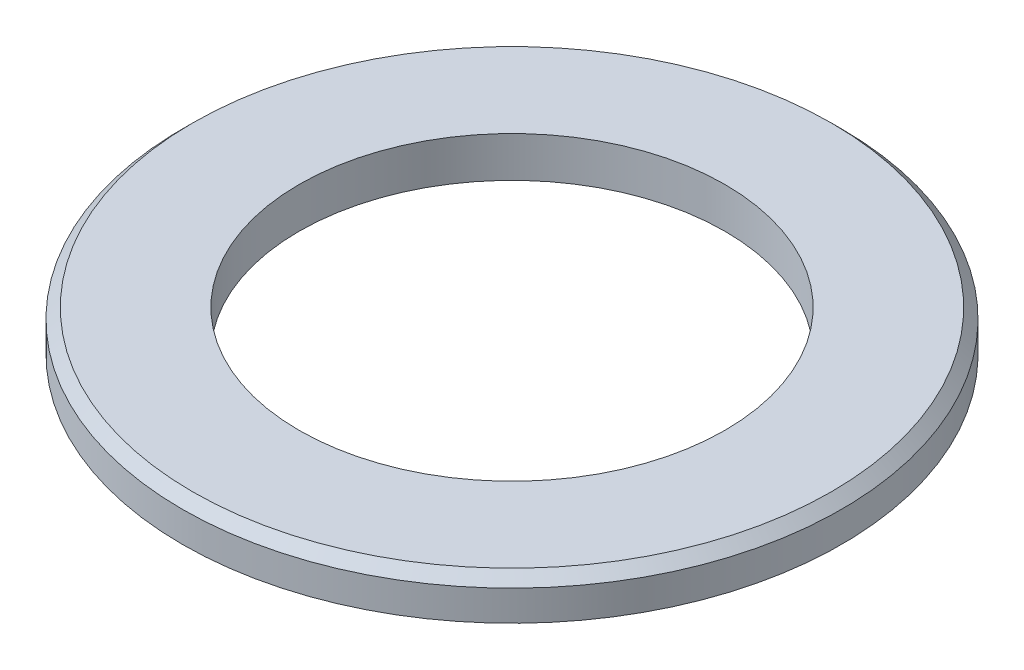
ISO-10303-21;
HEADER;
FILE_DESCRIPTION(('STEP AP214'),'2;1');
FILE_NAME('part.step','',(''),(''),'','','');
FILE_SCHEMA(('AUTOMOTIVE_DESIGN { 1 0 10303 214 1 1 1 1 }'));
ENDSEC;
DATA;
#1=APPLICATION_CONTEXT('core data for automotive mechanical design processes');
#2=APPLICATION_PROTOCOL_DEFINITION('international standard','automotive_design',2000,#1);
#3=PRODUCT_CONTEXT('',#1,'mechanical');
#4=PRODUCT('Part','Part','',(#3));
#5=PRODUCT_RELATED_PRODUCT_CATEGORY('part','',(#4));
#6=PRODUCT_DEFINITION_FORMATION('','',#4);
#7=PRODUCT_DEFINITION_CONTEXT('part definition',#1,'design');
#8=PRODUCT_DEFINITION('design','',#6,#7);
#9=PRODUCT_DEFINITION_SHAPE('','',#8);
#10=(LENGTH_UNIT() NAMED_UNIT(*) SI_UNIT(.MILLI.,.METRE.));
#11=(NAMED_UNIT(*) PLANE_ANGLE_UNIT() SI_UNIT($,.RADIAN.));
#12=(NAMED_UNIT(*) SI_UNIT($,.STERADIAN.) SOLID_ANGLE_UNIT());
#13=UNCERTAINTY_MEASURE_WITH_UNIT(LENGTH_MEASURE(1.E-05),#10,'distance_accuracy_value','');
#14=(GEOMETRIC_REPRESENTATION_CONTEXT(3) GLOBAL_UNCERTAINTY_ASSIGNED_CONTEXT((#13)) GLOBAL_UNIT_ASSIGNED_CONTEXT((#10,
#11,#12)) REPRESENTATION_CONTEXT('',''));
#15=CARTESIAN_POINT('',(0.,0.,0.));
#16=DIRECTION('',(0.,0.,1.));
#17=DIRECTION('',(1.,0.,0.));
#18=AXIS2_PLACEMENT_3D('',#15,#16,#17);
#19=CARTESIAN_POINT('',(0.,0.8,0.));
#20=DIRECTION('',(0.,1.,0.));
#21=DIRECTION('',(0.,0.,1.));
#22=AXIS2_PLACEMENT_3D('',#19,#20,#21);
#23=PLANE('',#22);
#24=CARTESIAN_POINT('',(0.,0.8,0.));
#25=DIRECTION('',(0.,1.,0.));
#26=DIRECTION('',(0.,0.,1.));
#27=AXIS2_PLACEMENT_3D('',#24,#25,#26);
#28=CIRCLE('',#27,6.3);
#29=CARTESIAN_POINT('',(0.,0.8,6.3));
#30=VERTEX_POINT('',#29);
#31=EDGE_CURVE('E39',#30,#30,#28,.T.);
#32=ORIENTED_EDGE('',*,*,#31,.T.);
#33=EDGE_LOOP('',(#32));
#34=FACE_BOUND('',#33,.T.);
#35=CARTESIAN_POINT('',(0.,0.8,0.));
#36=DIRECTION('',(0.,1.,0.));
#37=DIRECTION('',(0.,0.,1.));
#38=AXIS2_PLACEMENT_3D('',#35,#36,#37);
#39=CIRCLE('',#38,4.2);
#40=CARTESIAN_POINT('',(0.,0.8,4.2));
#41=VERTEX_POINT('',#40);
#42=EDGE_CURVE('E47',#41,#41,#39,.T.);
#43=ORIENTED_EDGE('',*,*,#42,.F.);
#44=EDGE_LOOP('',(#43));
#45=FACE_BOUND('',#44,.T.);
#46=ADVANCED_FACE('F32',(#34,#45),#23,.T.);
#47=CARTESIAN_POINT('',(0.,0.,0.));
#48=DIRECTION('',(0.,1.,0.));
#49=DIRECTION('',(0.,0.,1.));
#50=AXIS2_PLACEMENT_3D('',#47,#48,#49);
#51=PLANE('',#50);
#52=CARTESIAN_POINT('',(0.,0.,0.));
#53=DIRECTION('',(0.,1.,0.));
#54=DIRECTION('',(0.,0.,1.));
#55=AXIS2_PLACEMENT_3D('',#52,#53,#54);
#56=CIRCLE('',#55,6.5);
#57=CARTESIAN_POINT('',(0.,0.,6.5));
#58=VERTEX_POINT('',#57);
#59=EDGE_CURVE('E43',#58,#58,#56,.T.);
#60=ORIENTED_EDGE('',*,*,#59,.F.);
#61=EDGE_LOOP('',(#60));
#62=FACE_BOUND('',#61,.T.);
#63=CARTESIAN_POINT('',(0.,0.,0.));
#64=DIRECTION('',(0.,1.,0.));
#65=DIRECTION('',(0.,0.,1.));
#66=AXIS2_PLACEMENT_3D('',#63,#64,#65);
#67=CIRCLE('',#66,4.2);
#68=CARTESIAN_POINT('',(0.,0.,4.2));
#69=VERTEX_POINT('',#68);
#70=EDGE_CURVE('E50',#69,#69,#67,.T.);
#71=ORIENTED_EDGE('',*,*,#70,.T.);
#72=EDGE_LOOP('',(#71));
#73=FACE_BOUND('',#72,.T.);
#74=ADVANCED_FACE('F60',(#62,#73),#51,.F.);
#75=CARTESIAN_POINT('',(0.,0.8,0.));
#76=DIRECTION('',(0.,-1.,0.));
#77=DIRECTION('',(0.,0.,-1.));
#78=AXIS2_PLACEMENT_3D('',#75,#76,#77);
#79=CYLINDRICAL_SURFACE('',#78,6.5);
#80=CARTESIAN_POINT('',(0.,0.6,0.));
#81=DIRECTION('',(0.,1.,0.));
#82=DIRECTION('',(0.,0.,1.));
#83=AXIS2_PLACEMENT_3D('',#80,#81,#82);
#84=CIRCLE('',#83,6.5);
#85=CARTESIAN_POINT('',(0.,0.6,6.5));
#86=VERTEX_POINT('',#85);
#87=EDGE_CURVE('E10',#86,#86,#84,.F.);
#88=ORIENTED_EDGE('',*,*,#87,.T.);
#89=EDGE_LOOP('',(#88));
#90=FACE_BOUND('',#89,.T.);
#91=ORIENTED_EDGE('',*,*,#59,.T.);
#92=EDGE_LOOP('',(#91));
#93=FACE_BOUND('',#92,.T.);
#94=ADVANCED_FACE('F65',(#90,#93),#79,.T.);
#95=CARTESIAN_POINT('',(0.,0.8,0.));
#96=DIRECTION('',(0.,-1.,0.));
#97=DIRECTION('',(0.,0.,-1.));
#98=AXIS2_PLACEMENT_3D('',#95,#96,#97);
#99=CYLINDRICAL_SURFACE('',#98,4.2);
#100=ORIENTED_EDGE('',*,*,#42,.T.);
#101=EDGE_LOOP('',(#100));
#102=FACE_BOUND('',#101,.T.);
#103=ORIENTED_EDGE('',*,*,#70,.F.);
#104=EDGE_LOOP('',(#103));
#105=FACE_BOUND('',#104,.T.);
#106=ADVANCED_FACE('F56',(#102,#105),#99,.F.);
#107=CARTESIAN_POINT('',(0.,0.8,0.));
#108=DIRECTION('',(0.,-1.,0.));
#109=DIRECTION('',(0.,0.,-1.));
#110=AXIS2_PLACEMENT_3D('',#107,#108,#109);
#111=CONICAL_SURFACE('',#110,6.3,0.785398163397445);
#112=ORIENTED_EDGE('',*,*,#87,.F.);
#113=EDGE_LOOP('',(#112));
#114=FACE_BOUND('',#113,.T.);
#115=ORIENTED_EDGE('',*,*,#31,.F.);
#116=EDGE_LOOP('',(#115));
#117=FACE_BOUND('',#116,.T.);
#118=ADVANCED_FACE('F34',(#114,#117),#111,.T.);
#119=CLOSED_SHELL('',(#46,#74,#94,#106,#118));
#120=MANIFOLD_SOLID_BREP('B2',#119);
#121=ADVANCED_BREP_SHAPE_REPRESENTATION('',(#18,#120),#14);
#122=SHAPE_DEFINITION_REPRESENTATION(#9,#121);
ENDSEC;
END-ISO-10303-21;
